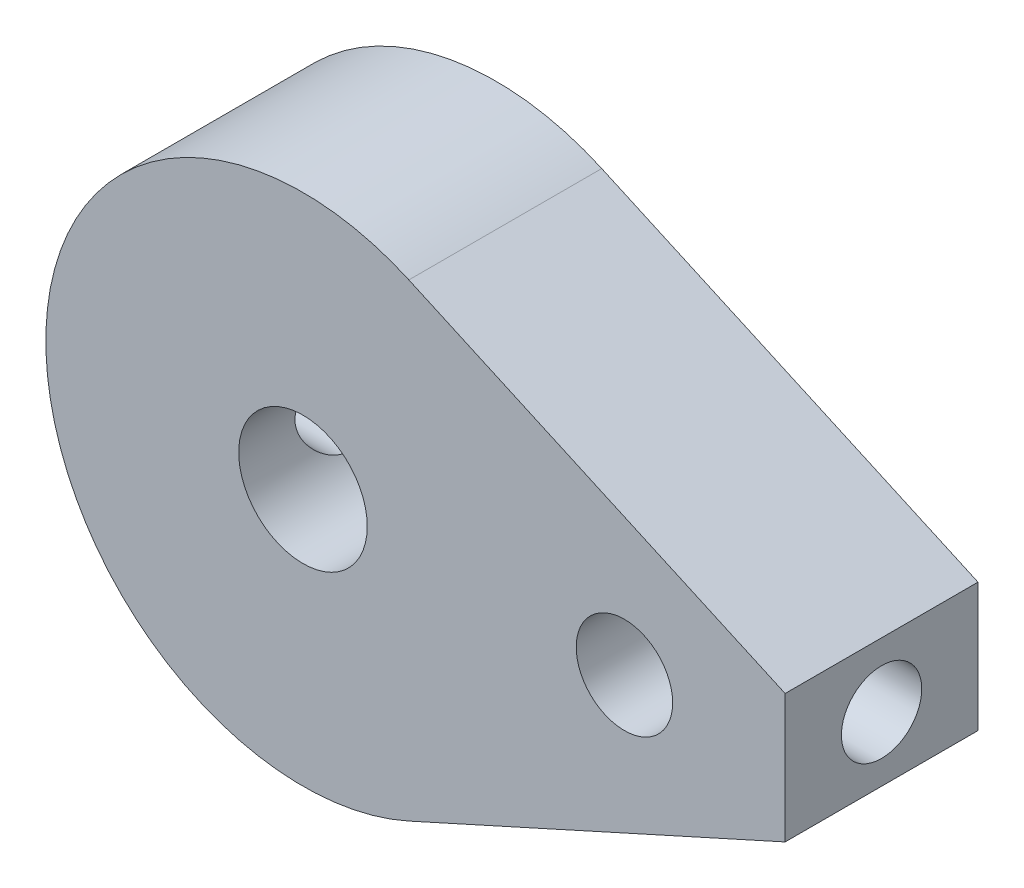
ISO-10303-21;
HEADER;
FILE_DESCRIPTION(('STEP AP214'),'2;1');
FILE_NAME('part.step','',(''),(''),'','','');
FILE_SCHEMA(('AUTOMOTIVE_DESIGN { 1 0 10303 214 1 1 1 1 }'));
ENDSEC;
DATA;
#1=APPLICATION_CONTEXT('core data for automotive mechanical design processes');
#2=APPLICATION_PROTOCOL_DEFINITION('international standard','automotive_design',2000,#1);
#3=PRODUCT_CONTEXT('',#1,'mechanical');
#4=PRODUCT('Part','Part','',(#3));
#5=PRODUCT_RELATED_PRODUCT_CATEGORY('part','',(#4));
#6=PRODUCT_DEFINITION_FORMATION('','',#4);
#7=PRODUCT_DEFINITION_CONTEXT('part definition',#1,'design');
#8=PRODUCT_DEFINITION('design','',#6,#7);
#9=PRODUCT_DEFINITION_SHAPE('','',#8);
#10=(LENGTH_UNIT() NAMED_UNIT(*) SI_UNIT(.MILLI.,.METRE.));
#11=(NAMED_UNIT(*) PLANE_ANGLE_UNIT() SI_UNIT($,.RADIAN.));
#12=(NAMED_UNIT(*) SI_UNIT($,.STERADIAN.) SOLID_ANGLE_UNIT());
#13=UNCERTAINTY_MEASURE_WITH_UNIT(LENGTH_MEASURE(1.E-05),#10,'distance_accuracy_value','');
#14=(GEOMETRIC_REPRESENTATION_CONTEXT(3) GLOBAL_UNCERTAINTY_ASSIGNED_CONTEXT((#13)) GLOBAL_UNIT_ASSIGNED_CONTEXT((#10,
#11,#12)) REPRESENTATION_CONTEXT('',''));
#15=CARTESIAN_POINT('',(0.,0.,0.));
#16=DIRECTION('',(0.,0.,1.));
#17=DIRECTION('',(1.,0.,0.));
#18=AXIS2_PLACEMENT_3D('',#15,#16,#17);
#19=CARTESIAN_POINT('',(-15.,0.,6.));
#20=DIRECTION('',(0.,0.,1.));
#21=DIRECTION('',(1.,0.,0.));
#22=AXIS2_PLACEMENT_3D('',#19,#20,#21);
#23=PLANE('',#22);
#24=CARTESIAN_POINT('',(-15.,0.,6.));
#25=DIRECTION('',(0.,0.,1.));
#26=DIRECTION('',(1.,0.,0.));
#27=AXIS2_PLACEMENT_3D('',#24,#25,#26);
#28=CIRCLE('',#27,2.);
#29=CARTESIAN_POINT('',(-13.,0.,6.));
#30=VERTEX_POINT('',#29);
#31=EDGE_CURVE('E104',#30,#30,#28,.T.);
#32=ORIENTED_EDGE('',*,*,#31,.F.);
#33=EDGE_LOOP('',(#32));
#34=FACE_BOUND('',#33,.T.);
#35=CARTESIAN_POINT('',(-15.,0.,6.));
#36=DIRECTION('',(0.,0.,1.));
#37=DIRECTION('',(1.,0.,0.));
#38=AXIS2_PLACEMENT_3D('',#35,#36,#37);
#39=CIRCLE('',#38,8.);
#40=CARTESIAN_POINT('',(-11.7053437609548,7.29007820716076,6.));
#41=VERTEX_POINT('',#40);
#42=CARTESIAN_POINT('',(-11.7053437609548,-7.29007820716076,6.));
#43=VERTEX_POINT('',#42);
#44=EDGE_CURVE('E89',#41,#43,#39,.T.);
#45=ORIENTED_EDGE('',*,*,#44,.T.);
#46=DIRECTION('',(0.911259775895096,0.411832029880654,0.));
#47=VECTOR('',#46,1.);
#48=CARTESIAN_POINT('',(0.,-2.,6.));
#49=LINE('',#48,#47);
#50=CARTESIAN_POINT('',(0.,-2.,6.));
#51=VERTEX_POINT('',#50);
#52=EDGE_CURVE('E84',#43,#51,#49,.T.);
#53=ORIENTED_EDGE('',*,*,#52,.T.);
#54=DIRECTION('',(0.,1.,0.));
#55=VECTOR('',#54,1.);
#56=CARTESIAN_POINT('',(0.,-2.,6.));
#57=LINE('',#56,#55);
#58=CARTESIAN_POINT('',(0.,2.,6.));
#59=VERTEX_POINT('',#58);
#60=EDGE_CURVE('E87',#51,#59,#57,.T.);
#61=ORIENTED_EDGE('',*,*,#60,.T.);
#62=DIRECTION('',(-0.911259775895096,0.411832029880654,0.));
#63=VECTOR('',#62,1.);
#64=CARTESIAN_POINT('',(0.,2.,6.));
#65=LINE('',#64,#63);
#66=EDGE_CURVE('E54',#59,#41,#65,.T.);
#67=ORIENTED_EDGE('',*,*,#66,.T.);
#68=EDGE_LOOP('',(#45,#53,#61,#67));
#69=FACE_BOUND('',#68,.T.);
#70=CARTESIAN_POINT('',(-5.,0.,6.));
#71=DIRECTION('',(0.,0.,1.));
#72=DIRECTION('',(1.,0.,0.));
#73=AXIS2_PLACEMENT_3D('',#70,#71,#72);
#74=CIRCLE('',#73,1.5);
#75=CARTESIAN_POINT('',(-3.5,0.,6.));
#76=VERTEX_POINT('',#75);
#77=EDGE_CURVE('E119',#76,#76,#74,.T.);
#78=ORIENTED_EDGE('',*,*,#77,.F.);
#79=EDGE_LOOP('',(#78));
#80=FACE_BOUND('',#79,.T.);
#81=ADVANCED_FACE('F36',(#34,#69,#80),#23,.T.);
#82=CARTESIAN_POINT('',(-15.,0.,0.));
#83=DIRECTION('',(0.,0.,1.));
#84=DIRECTION('',(1.,0.,0.));
#85=AXIS2_PLACEMENT_3D('',#82,#83,#84);
#86=PLANE('',#85);
#87=CARTESIAN_POINT('',(-15.,0.,0.));
#88=DIRECTION('',(0.,0.,1.));
#89=DIRECTION('',(1.,0.,0.));
#90=AXIS2_PLACEMENT_3D('',#87,#88,#89);
#91=CIRCLE('',#90,8.);
#92=CARTESIAN_POINT('',(-11.7053437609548,7.29007820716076,0.));
#93=VERTEX_POINT('',#92);
#94=CARTESIAN_POINT('',(-11.7053437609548,-7.29007820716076,0.));
#95=VERTEX_POINT('',#94);
#96=EDGE_CURVE('E101',#93,#95,#91,.T.);
#97=ORIENTED_EDGE('',*,*,#96,.F.);
#98=DIRECTION('',(-0.911259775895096,0.411832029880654,0.));
#99=VECTOR('',#98,1.);
#100=CARTESIAN_POINT('',(0.,2.,0.));
#101=LINE('',#100,#99);
#102=CARTESIAN_POINT('',(0.,2.,0.));
#103=VERTEX_POINT('',#102);
#104=EDGE_CURVE('E77',#103,#93,#101,.T.);
#105=ORIENTED_EDGE('',*,*,#104,.F.);
#106=DIRECTION('',(0.,1.,0.));
#107=VECTOR('',#106,1.);
#108=CARTESIAN_POINT('',(0.,-2.,0.));
#109=LINE('',#108,#107);
#110=CARTESIAN_POINT('',(0.,-2.,0.));
#111=VERTEX_POINT('',#110);
#112=EDGE_CURVE('E71',#111,#103,#109,.T.);
#113=ORIENTED_EDGE('',*,*,#112,.F.);
#114=DIRECTION('',(0.911259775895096,0.411832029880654,0.));
#115=VECTOR('',#114,1.);
#116=CARTESIAN_POINT('',(0.,-2.,0.));
#117=LINE('',#116,#115);
#118=EDGE_CURVE('E93',#95,#111,#117,.T.);
#119=ORIENTED_EDGE('',*,*,#118,.F.);
#120=EDGE_LOOP('',(#97,#105,#113,#119));
#121=FACE_BOUND('',#120,.T.);
#122=CARTESIAN_POINT('',(-15.,0.,0.));
#123=DIRECTION('',(0.,0.,1.));
#124=DIRECTION('',(1.,0.,0.));
#125=AXIS2_PLACEMENT_3D('',#122,#123,#124);
#126=CIRCLE('',#125,2.);
#127=CARTESIAN_POINT('',(-13.,0.,0.));
#128=VERTEX_POINT('',#127);
#129=EDGE_CURVE('E116',#128,#128,#126,.T.);
#130=ORIENTED_EDGE('',*,*,#129,.T.);
#131=EDGE_LOOP('',(#130));
#132=FACE_BOUND('',#131,.T.);
#133=CARTESIAN_POINT('',(-5.,0.,0.));
#134=DIRECTION('',(0.,0.,1.));
#135=DIRECTION('',(1.,0.,0.));
#136=AXIS2_PLACEMENT_3D('',#133,#134,#135);
#137=CIRCLE('',#136,1.5);
#138=CARTESIAN_POINT('',(-3.5,0.,0.));
#139=VERTEX_POINT('',#138);
#140=EDGE_CURVE('E122',#139,#139,#137,.T.);
#141=ORIENTED_EDGE('',*,*,#140,.T.);
#142=EDGE_LOOP('',(#141));
#143=FACE_BOUND('',#142,.T.);
#144=ADVANCED_FACE('F112',(#121,#132,#143),#86,.F.);
#145=CARTESIAN_POINT('',(-15.,0.,6.));
#146=DIRECTION('',(0.,0.,-1.));
#147=DIRECTION('',(-1.,0.,0.));
#148=AXIS2_PLACEMENT_3D('',#145,#146,#147);
#149=CYLINDRICAL_SURFACE('',#148,8.);
#150=CARTESIAN_POINT('',(-23.,0.,4.24999999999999));
#151=CARTESIAN_POINT('',(-22.9999988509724,-0.069757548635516,4.24999715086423));
#152=CARTESIAN_POINT('',(-22.9990780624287,-0.139554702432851,4.24414094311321));
#153=CARTESIAN_POINT('',(-22.995493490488,-0.277195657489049,4.22087815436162));
#154=CARTESIAN_POINT('',(-22.9928280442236,-0.345037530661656,4.20346055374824));
#155=CARTESIAN_POINT('',(-22.9860534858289,-0.476756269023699,4.15761016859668));
#156=CARTESIAN_POINT('',(-22.9819454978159,-0.540636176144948,4.12918595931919));
#157=CARTESIAN_POINT('',(-22.9727389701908,-0.662710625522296,4.06215072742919));
#158=CARTESIAN_POINT('',(-22.9676405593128,-0.72090590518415,4.02354102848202));
#159=CARTESIAN_POINT('',(-22.9569713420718,-0.830459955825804,3.93688347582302));
#160=CARTESIAN_POINT('',(-22.9513972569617,-0.881763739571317,3.88876650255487));
#161=CARTESIAN_POINT('',(-22.9404303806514,-0.97560384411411,3.78460902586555));
#162=CARTESIAN_POINT('',(-22.9350376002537,-1.01813964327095,3.7285680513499));
#163=CARTESIAN_POINT('',(-22.9250121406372,-1.09345272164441,3.60978086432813));
#164=CARTESIAN_POINT('',(-22.9203836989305,-1.12617636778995,3.5470002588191));
#165=CARTESIAN_POINT('',(-22.9124560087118,-1.18059340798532,3.4167492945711));
#166=CARTESIAN_POINT('',(-22.9091566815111,-1.20228745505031,3.34927921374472));
#167=CARTESIAN_POINT('',(-22.9042931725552,-1.23385779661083,3.21214454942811));
#168=CARTESIAN_POINT('',(-22.9027151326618,-1.24382852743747,3.1425022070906));
#169=CARTESIAN_POINT('',(-22.9014308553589,-1.2519618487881,3.00251640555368));
#170=CARTESIAN_POINT('',(-22.9017245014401,-1.25012517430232,2.93217299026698));
#171=CARTESIAN_POINT('',(-22.904137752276,-1.23477290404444,2.79345148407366));
#172=CARTESIAN_POINT('',(-22.9062408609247,-1.22136281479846,2.72506138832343));
#173=CARTESIAN_POINT('',(-22.9120102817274,-1.18340968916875,2.59151399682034));
#174=CARTESIAN_POINT('',(-22.9156766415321,-1.15886631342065,2.52635679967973));
#175=CARTESIAN_POINT('',(-22.9241775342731,-1.09923458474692,2.40080564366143));
#176=CARTESIAN_POINT('',(-22.9290169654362,-1.06410186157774,2.34043310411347));
#177=CARTESIAN_POINT('',(-22.9393152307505,-0.98432029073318,2.22640023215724));
#178=CARTESIAN_POINT('',(-22.9447741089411,-0.939670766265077,2.17274037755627));
#179=CARTESIAN_POINT('',(-22.9557689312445,-0.841545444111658,2.07304487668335));
#180=CARTESIAN_POINT('',(-22.9613050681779,-0.78797900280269,2.02709842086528));
#181=CARTESIAN_POINT('',(-22.9717756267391,-0.673848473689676,1.94483342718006));
#182=CARTESIAN_POINT('',(-22.9767100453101,-0.613284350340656,1.90851493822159));
#183=CARTESIAN_POINT('',(-22.9854269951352,-0.486797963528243,1.84653096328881));
#184=CARTESIAN_POINT('',(-22.9892087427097,-0.420872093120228,1.82087272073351));
#185=CARTESIAN_POINT('',(-22.9951878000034,-0.285574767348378,1.78101701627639));
#186=CARTESIAN_POINT('',(-22.9973852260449,-0.216203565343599,1.76681871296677));
#187=CARTESIAN_POINT('',(-22.9999325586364,-0.0767541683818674,1.75040536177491));
#188=CARTESIAN_POINT('',(-23.0003013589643,-0.00669073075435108,1.74806776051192));
#189=CARTESIAN_POINT('',(-22.9992014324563,0.13282727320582,1.755116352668));
#190=CARTESIAN_POINT('',(-22.9977327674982,0.202281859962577,1.76450215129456));
#191=CARTESIAN_POINT('',(-22.9931346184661,0.33823672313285,1.7946291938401));
#192=CARTESIAN_POINT('',(-22.9900139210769,0.404750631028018,1.81531037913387));
#193=CARTESIAN_POINT('',(-22.9824603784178,0.53336703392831,1.8673775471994));
#194=CARTESIAN_POINT('',(-22.9780274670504,0.5954693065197,1.89876406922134));
#195=CARTESIAN_POINT('',(-22.9682948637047,0.714036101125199,1.97163599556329));
#196=CARTESIAN_POINT('',(-22.9629886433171,0.770452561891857,2.01319871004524));
#197=CARTESIAN_POINT('',(-22.9521194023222,0.875553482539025,2.1051360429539));
#198=CARTESIAN_POINT('',(-22.9465563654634,0.924237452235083,2.15551121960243));
#199=CARTESIAN_POINT('',(-22.9357401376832,1.01294040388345,2.26419059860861));
#200=CARTESIAN_POINT('',(-22.930490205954,1.05287699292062,2.32256242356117));
#201=CARTESIAN_POINT('',(-22.9209534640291,1.12237783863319,2.44525803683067));
#202=CARTESIAN_POINT('',(-22.91666662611,1.15194239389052,2.50958165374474));
#203=CARTESIAN_POINT('',(-22.9095653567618,1.19973385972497,2.6421148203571));
#204=CARTESIAN_POINT('',(-22.9067454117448,1.21800327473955,2.71030873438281));
#205=CARTESIAN_POINT('',(-22.902882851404,1.24282061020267,2.84884457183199));
#206=CARTESIAN_POINT('',(-22.9018401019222,1.24936941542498,2.9191863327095));
#207=CARTESIAN_POINT('',(-22.9016552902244,1.25053726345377,3.05919935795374));
#208=CARTESIAN_POINT('',(-22.9024925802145,1.24528590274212,3.12886954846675));
#209=CARTESIAN_POINT('',(-22.9059284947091,1.2232811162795,3.26632264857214));
#210=CARTESIAN_POINT('',(-22.9085271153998,1.2065277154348,3.33410556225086));
#211=CARTESIAN_POINT('',(-22.9151854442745,1.16204164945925,3.46581891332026));
#212=CARTESIAN_POINT('',(-22.919243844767,1.1343188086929,3.5297527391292));
#213=CARTESIAN_POINT('',(-22.928365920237,1.06869384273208,3.65208280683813));
#214=CARTESIAN_POINT('',(-22.9334296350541,1.03079131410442,3.71047882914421));
#215=CARTESIAN_POINT('',(-22.9440578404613,0.945415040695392,3.82073277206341));
#216=CARTESIAN_POINT('',(-22.9496270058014,0.897845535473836,3.87251609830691));
#217=CARTESIAN_POINT('',(-22.9606002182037,0.794687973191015,3.96741061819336));
#218=CARTESIAN_POINT('',(-22.9660042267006,0.739098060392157,4.01051979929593));
#219=CARTESIAN_POINT('',(-22.9760755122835,0.621083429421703,4.08707561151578));
#220=CARTESIAN_POINT('',(-22.9807381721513,0.558619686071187,4.1204626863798));
#221=CARTESIAN_POINT('',(-22.9887562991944,0.428925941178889,4.17622049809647));
#222=CARTESIAN_POINT('',(-22.9921131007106,0.361700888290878,4.19860248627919));
#223=CARTESIAN_POINT('',(-22.9963872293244,0.245157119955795,4.22671651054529));
#224=CARTESIAN_POINT('',(-22.9977349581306,0.19655278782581,4.23543424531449));
#225=CARTESIAN_POINT('',(-22.9995417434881,0.0986388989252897,4.24707695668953));
#226=CARTESIAN_POINT('',(-23.0000008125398,0.0493293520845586,4.25000201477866));
#227=CARTESIAN_POINT('',(-23.,0.,4.24999999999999));
#228=B_SPLINE_CURVE_WITH_KNOTS('',3,(#150,#151,#152,#153,#154,#155,#156,#157,#158,#159,#160,
#161,#162,#163,#164,#165,#166,#167,#168,#169,#170,#171,#172,#173,#174,#175,#176,#177,#178,#179,
#180,#181,#182,#183,#184,#185,#186,#187,#188,#189,#190,#191,#192,#193,#194,#195,#196,#197,#198,
#199,#200,#201,#202,#203,#204,#205,#206,#207,#208,#209,#210,#211,#212,#213,#214,#215,#216,#217,
#218,#219,#220,#221,#222,#223,#224,#225,#226,#227),.UNSPECIFIED.,.T.,.F.,(4,2,2,2,2,2,2,2,2,2,2,
2,2,2,2,2,2,2,2,2,2,2,2,2,2,2,2,2,2,2,2,2,2,2,2,2,2,2,4),(0.,0.209092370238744,
0.418384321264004,0.62751353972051,0.836615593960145,1.04729784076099,1.2579926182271,
1.46981889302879,1.68163262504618,1.89172815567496,2.10181060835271,2.30999788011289,
2.51819149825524,2.72726988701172,2.93636314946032,3.14772866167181,3.35909524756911,
3.5706052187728,3.78209965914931,3.99140427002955,4.20070183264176,4.40889722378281,
4.61710310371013,4.82694270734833,5.03679560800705,5.24854740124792,5.46029309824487,
5.67123705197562,5.88216508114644,6.09078790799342,6.29941028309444,6.50784623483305,
6.7162904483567,6.92691006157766,7.13757848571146,7.34951152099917,7.56122742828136,
7.70909008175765,7.8569506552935),.UNSPECIFIED.);
#229=CARTESIAN_POINT('',(-23.,0.,4.24999999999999));
#230=VERTEX_POINT('',#229);
#231=EDGE_CURVE('E153',#230,#230,#228,.T.);
#232=ORIENTED_EDGE('',*,*,#231,.T.);
#233=EDGE_LOOP('',(#232));
#234=FACE_BOUND('',#233,.T.);
#235=ORIENTED_EDGE('',*,*,#96,.T.);
#236=DIRECTION('',(0.,0.,-1.));
#237=VECTOR('',#236,1.);
#238=CARTESIAN_POINT('',(-11.7053437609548,-7.29007820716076,6.));
#239=LINE('',#238,#237);
#240=EDGE_CURVE('E11',#43,#95,#239,.T.);
#241=ORIENTED_EDGE('',*,*,#240,.F.);
#242=ORIENTED_EDGE('',*,*,#44,.F.);
#243=DIRECTION('',(0.,0.,-1.));
#244=VECTOR('',#243,1.);
#245=CARTESIAN_POINT('',(-11.7053437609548,7.29007820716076,6.));
#246=LINE('',#245,#244);
#247=EDGE_CURVE('E97',#41,#93,#246,.T.);
#248=ORIENTED_EDGE('',*,*,#247,.T.);
#249=EDGE_LOOP('',(#235,#241,#242,#248));
#250=FACE_BOUND('',#249,.T.);
#251=ADVANCED_FACE('F38',(#234,#250),#149,.T.);
#252=CARTESIAN_POINT('',(0.,-2.,6.));
#253=DIRECTION('',(-0.411832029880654,0.911259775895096,0.));
#254=DIRECTION('',(-0.911259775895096,-0.411832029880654,0.));
#255=AXIS2_PLACEMENT_3D('',#252,#253,#254);
#256=PLANE('',#255);
#257=ORIENTED_EDGE('',*,*,#118,.T.);
#258=DIRECTION('',(0.,0.,-1.));
#259=VECTOR('',#258,1.);
#260=CARTESIAN_POINT('',(0.,-2.,6.));
#261=LINE('',#260,#259);
#262=EDGE_CURVE('E46',#51,#111,#261,.T.);
#263=ORIENTED_EDGE('',*,*,#262,.F.);
#264=ORIENTED_EDGE('',*,*,#52,.F.);
#265=ORIENTED_EDGE('',*,*,#240,.T.);
#266=EDGE_LOOP('',(#257,#263,#264,#265));
#267=FACE_BOUND('',#266,.T.);
#268=ADVANCED_FACE('F92',(#267),#256,.F.);
#269=CARTESIAN_POINT('',(0.,-2.,6.));
#270=DIRECTION('',(-1.,0.,0.));
#271=DIRECTION('',(0.,0.,1.));
#272=AXIS2_PLACEMENT_3D('',#269,#270,#271);
#273=PLANE('',#272);
#274=CARTESIAN_POINT('',(0.,0.,3.));
#275=DIRECTION('',(1.,0.,0.));
#276=DIRECTION('',(0.,0.,-1.));
#277=AXIS2_PLACEMENT_3D('',#274,#275,#276);
#278=CIRCLE('',#277,1.24999999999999);
#279=CARTESIAN_POINT('',(0.,0.,1.75000000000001));
#280=VERTEX_POINT('',#279);
#281=EDGE_CURVE('E134',#280,#280,#278,.T.);
#282=ORIENTED_EDGE('',*,*,#281,.F.);
#283=EDGE_LOOP('',(#282));
#284=FACE_BOUND('',#283,.T.);
#285=ORIENTED_EDGE('',*,*,#112,.T.);
#286=DIRECTION('',(0.,0.,-1.));
#287=VECTOR('',#286,1.);
#288=CARTESIAN_POINT('',(0.,2.,6.));
#289=LINE('',#288,#287);
#290=EDGE_CURVE('E94',#59,#103,#289,.T.);
#291=ORIENTED_EDGE('',*,*,#290,.F.);
#292=ORIENTED_EDGE('',*,*,#60,.F.);
#293=ORIENTED_EDGE('',*,*,#262,.T.);
#294=EDGE_LOOP('',(#285,#291,#292,#293));
#295=FACE_BOUND('',#294,.T.);
#296=ADVANCED_FACE('F95',(#284,#295),#273,.F.);
#297=CARTESIAN_POINT('',(0.,2.,6.));
#298=DIRECTION('',(-0.411832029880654,-0.911259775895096,0.));
#299=DIRECTION('',(0.911259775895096,-0.411832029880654,0.));
#300=AXIS2_PLACEMENT_3D('',#297,#298,#299);
#301=PLANE('',#300);
#302=ORIENTED_EDGE('',*,*,#104,.T.);
#303=ORIENTED_EDGE('',*,*,#247,.F.);
#304=ORIENTED_EDGE('',*,*,#66,.F.);
#305=ORIENTED_EDGE('',*,*,#290,.T.);
#306=EDGE_LOOP('',(#302,#303,#304,#305));
#307=FACE_BOUND('',#306,.T.);
#308=ADVANCED_FACE('F109',(#307),#301,.F.);
#309=CARTESIAN_POINT('',(-15.,0.,6.));
#310=DIRECTION('',(0.,0.,-1.));
#311=DIRECTION('',(-1.,0.,0.));
#312=AXIS2_PLACEMENT_3D('',#309,#310,#311);
#313=CYLINDRICAL_SURFACE('',#312,2.);
#314=CARTESIAN_POINT('',(-17.,0.,4.24999999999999));
#315=CARTESIAN_POINT('',(-16.9999959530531,-0.0635104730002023,4.24999565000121));
#316=CARTESIAN_POINT('',(-16.99694323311,-0.127096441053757,4.24512698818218));
#317=CARTESIAN_POINT('',(-16.985021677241,-0.252318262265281,4.22591419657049));
#318=CARTESIAN_POINT('',(-16.976141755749,-0.313950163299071,4.21155200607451));
#319=CARTESIAN_POINT('',(-16.9534585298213,-0.43320555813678,4.17418863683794));
#320=CARTESIAN_POINT('',(-16.9396796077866,-0.490847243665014,4.15123021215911));
#321=CARTESIAN_POINT('',(-16.9083459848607,-0.601260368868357,4.09761414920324));
#322=CARTESIAN_POINT('',(-16.8907917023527,-0.654032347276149,4.0669573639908));
#323=CARTESIAN_POINT('',(-16.8517015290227,-0.75797419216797,3.99611342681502));
#324=CARTESIAN_POINT('',(-16.8299596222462,-0.808679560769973,3.95536070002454));
#325=CARTESIAN_POINT('',(-16.7853134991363,-0.902986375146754,3.86678082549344));
#326=CARTESIAN_POINT('',(-16.7624077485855,-0.946578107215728,3.81894417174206));
#327=CARTESIAN_POINT('',(-16.714304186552,-1.03142873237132,3.70996610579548));
#328=CARTESIAN_POINT('',(-16.6892161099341,-1.0715720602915,3.64790021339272));
#329=CARTESIAN_POINT('',(-16.6433019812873,-1.14073966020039,3.51643518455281));
#330=CARTESIAN_POINT('',(-16.6224687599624,-1.16978270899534,3.44704868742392));
#331=CARTESIAN_POINT('',(-16.5930957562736,-1.2093340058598,3.32118947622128));
#332=CARTESIAN_POINT('',(-16.5827690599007,-1.22269552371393,3.26603318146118));
#333=CARTESIAN_POINT('',(-16.5678135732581,-1.24181843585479,3.1536940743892));
#334=CARTESIAN_POINT('',(-16.5631767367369,-1.24759056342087,3.09651424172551));
#335=CARTESIAN_POINT('',(-16.5602988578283,-1.25118918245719,2.98158698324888));
#336=CARTESIAN_POINT('',(-16.5620745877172,-1.2489948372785,2.9238384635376));
#337=CARTESIAN_POINT('',(-16.5717740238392,-1.23676317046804,2.80968989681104));
#338=CARTESIAN_POINT('',(-16.5797026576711,-1.22671956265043,2.75329096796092));
#339=CARTESIAN_POINT('',(-16.6003257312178,-1.19968103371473,2.64456154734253));
#340=CARTESIAN_POINT('',(-16.6129071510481,-1.18285016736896,2.59216754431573));
#341=CARTESIAN_POINT('',(-16.6414556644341,-1.14290189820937,2.49083881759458));
#342=CARTESIAN_POINT('',(-16.6574239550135,-1.11978227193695,2.44190532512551));
#343=CARTESIAN_POINT('',(-16.6945481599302,-1.06294892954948,2.33916672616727));
#344=CARTESIAN_POINT('',(-16.7161159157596,-1.0280629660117,2.28615918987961));
#345=CARTESIAN_POINT('',(-16.7600571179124,-0.950881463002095,2.18616972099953));
#346=CARTESIAN_POINT('',(-16.7824313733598,-0.908578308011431,2.13919406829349));
#347=CARTESIAN_POINT('',(-16.8297989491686,-0.809519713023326,2.04469825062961));
#348=CARTESIAN_POINT('',(-16.8546153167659,-0.751531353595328,1.99836702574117));
#349=CARTESIAN_POINT('',(-16.9002805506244,-0.627148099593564,1.91614910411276));
#350=CARTESIAN_POINT('',(-16.9211309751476,-0.560756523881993,1.88025830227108));
#351=CARTESIAN_POINT('',(-16.9555337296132,-0.424883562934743,1.82223631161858));
#352=CARTESIAN_POINT('',(-16.9694197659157,-0.355763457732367,1.79946596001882));
#353=CARTESIAN_POINT('',(-16.9898492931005,-0.213612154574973,1.76623507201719));
#354=CARTESIAN_POINT('',(-16.9964031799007,-0.140586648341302,1.755757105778));
#355=CARTESIAN_POINT('',(-17.0009784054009,-0.00451561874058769,1.74843414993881));
#356=CARTESIAN_POINT('',(-17.0001216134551,0.058402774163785,1.74979682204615));
#357=CARTESIAN_POINT('',(-16.9925890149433,0.182972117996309,1.76188282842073));
#358=CARTESIAN_POINT('',(-16.9859136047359,0.244623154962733,1.77260552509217));
#359=CARTESIAN_POINT('',(-16.9677405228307,0.362521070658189,1.80223853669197));
#360=CARTESIAN_POINT('',(-16.9564417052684,0.418885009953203,1.82081215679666));
#361=CARTESIAN_POINT('',(-16.9299568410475,0.527638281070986,1.86529638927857));
#362=CARTESIAN_POINT('',(-16.9147701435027,0.580026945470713,1.89120823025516));
#363=CARTESIAN_POINT('',(-16.87990012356,0.685084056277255,1.95251520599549));
#364=CARTESIAN_POINT('',(-16.8599176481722,0.737246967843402,1.98860356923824));
#365=CARTESIAN_POINT('',(-16.8180697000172,0.835142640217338,2.06779386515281));
#366=CARTESIAN_POINT('',(-16.7962021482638,0.88086815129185,2.11090358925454));
#367=CARTESIAN_POINT('',(-16.7490586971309,0.971474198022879,2.21013503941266));
#368=CARTESIAN_POINT('',(-16.7237488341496,1.01526851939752,2.26723720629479));
#369=CARTESIAN_POINT('',(-16.6756676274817,1.09280351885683,2.38887578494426));
#370=CARTESIAN_POINT('',(-16.6528945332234,1.12655115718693,2.453407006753));
#371=CARTESIAN_POINT('',(-16.6173353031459,1.17684772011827,2.57469214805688));
#372=CARTESIAN_POINT('',(-16.6034563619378,1.19551895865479,2.63024075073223));
#373=CARTESIAN_POINT('',(-16.5810503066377,1.22500108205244,2.74439314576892));
#374=CARTESIAN_POINT('',(-16.5725148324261,1.23582424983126,2.80299200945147));
#375=CARTESIAN_POINT('',(-16.5620632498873,1.24901383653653,2.92209027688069));
#376=CARTESIAN_POINT('',(-16.5601850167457,1.25133186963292,2.98259858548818));
#377=CARTESIAN_POINT('',(-16.5634906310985,1.24719778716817,3.10313096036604));
#378=CARTESIAN_POINT('',(-16.5686768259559,1.24074275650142,3.16315485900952));
#379=CARTESIAN_POINT('',(-16.5845538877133,1.22038272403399,3.27602979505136));
#380=CARTESIAN_POINT('',(-16.5947680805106,1.20711919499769,3.32906930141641));
#381=CARTESIAN_POINT('',(-16.6191753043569,1.17417623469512,3.43213505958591));
#382=CARTESIAN_POINT('',(-16.6333699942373,1.15449412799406,3.48216004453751));
#383=CARTESIAN_POINT('',(-16.6666390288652,1.10602690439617,3.5855967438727));
#384=CARTESIAN_POINT('',(-16.68612230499,1.07633644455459,3.63845029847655));
#385=CARTESIAN_POINT('',(-16.7266770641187,1.01000017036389,3.73893836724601));
#386=CARTESIAN_POINT('',(-16.7477498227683,0.973348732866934,3.78656861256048));
#387=CARTESIAN_POINT('',(-16.7940191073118,0.885670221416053,3.88501425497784));
#388=CARTESIAN_POINT('',(-16.8192054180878,0.833233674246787,3.93459084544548));
#389=CARTESIAN_POINT('',(-16.8669872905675,0.719822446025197,4.02449482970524));
#390=CARTESIAN_POINT('',(-16.8895812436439,0.658842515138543,4.0648164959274));
#391=CARTESIAN_POINT('',(-16.9298671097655,0.529355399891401,4.1347711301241));
#392=CARTESIAN_POINT('',(-16.9475507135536,0.460835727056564,4.16438600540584));
#393=CARTESIAN_POINT('',(-16.9758152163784,0.318394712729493,4.21107188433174));
#394=CARTESIAN_POINT('',(-16.9864212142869,0.244493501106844,4.22818723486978));
#395=CARTESIAN_POINT('',(-16.9951947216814,0.14141848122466,4.24229920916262));
#396=CARTESIAN_POINT('',(-16.996991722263,0.113248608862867,4.24518186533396));
#397=CARTESIAN_POINT('',(-16.9993953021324,0.0567241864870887,4.2490332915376));
#398=CARTESIAN_POINT('',(-17.0000018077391,0.0283696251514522,4.25000194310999));
#399=CARTESIAN_POINT('',(-17.,0.,4.24999999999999));
#400=B_SPLINE_CURVE_WITH_KNOTS('',3,(#314,#315,#316,#317,#318,#319,#320,#321,#322,#323,#324,
#325,#326,#327,#328,#329,#330,#331,#332,#333,#334,#335,#336,#337,#338,#339,#340,#341,#342,#343,
#344,#345,#346,#347,#348,#349,#350,#351,#352,#353,#354,#355,#356,#357,#358,#359,#360,#361,#362,
#363,#364,#365,#366,#367,#368,#369,#370,#371,#372,#373,#374,#375,#376,#377,#378,#379,#380,#381,
#382,#383,#384,#385,#386,#387,#388,#389,#390,#391,#392,#393,#394,#395,#396,#397,#398,#399),
.UNSPECIFIED.,.T.,.F.,(4,2,2,2,2,2,2,2,2,2,2,2,2,2,2,2,2,2,2,2,2,2,2,2,2,2,2,2,2,2,2,2,2,2,2,2,
2,2,2,2,2,2,4),(0.,0.190412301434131,0.38118789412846,0.571026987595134,0.760845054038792,
0.965821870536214,1.17107628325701,1.40412975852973,1.6367872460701,1.80912008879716,
1.9812089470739,2.15374823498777,2.32642584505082,2.49515839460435,2.66395067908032,
2.86427450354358,3.0648052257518,3.2984218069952,3.53194640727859,3.75284174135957,
3.97342347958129,4.16127180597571,4.34910733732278,4.52959504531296,4.71011298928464,
4.9088523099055,5.10781368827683,5.3356570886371,5.56334227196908,5.74329940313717,
5.92297427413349,6.10366974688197,6.28442527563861,6.45063169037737,6.61690747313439,
6.80725523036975,6.99775741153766,7.22600539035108,7.45439424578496,7.68316725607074,
7.91112460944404,7.99617501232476,8.08123067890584),.UNSPECIFIED.);
#401=CARTESIAN_POINT('',(-17.,0.,4.24999999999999));
#402=VERTEX_POINT('',#401);
#403=EDGE_CURVE('E149',#402,#402,#400,.T.);
#404=ORIENTED_EDGE('',*,*,#403,.F.);
#405=EDGE_LOOP('',(#404));
#406=FACE_BOUND('',#405,.T.);
#407=ORIENTED_EDGE('',*,*,#31,.T.);
#408=EDGE_LOOP('',(#407));
#409=FACE_BOUND('',#408,.T.);
#410=ORIENTED_EDGE('',*,*,#129,.F.);
#411=EDGE_LOOP('',(#410));
#412=FACE_BOUND('',#411,.T.);
#413=ADVANCED_FACE('F169',(#406,#409,#412),#313,.F.);
#414=CARTESIAN_POINT('',(-5.,0.,6.));
#415=DIRECTION('',(0.,0.,-1.));
#416=DIRECTION('',(-1.,0.,0.));
#417=AXIS2_PLACEMENT_3D('',#414,#415,#416);
#418=CYLINDRICAL_SURFACE('',#417,1.5);
#419=CARTESIAN_POINT('',(-3.5,0.,1.75000000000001));
#420=CARTESIAN_POINT('',(-3.50000239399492,-0.0593787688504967,1.75000244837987));
#421=CARTESIAN_POINT('',(-3.50355666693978,-0.118775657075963,1.75426126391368));
#422=CARTESIAN_POINT('',(-3.51744616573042,-0.235591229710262,1.77098134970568));
#423=CARTESIAN_POINT('',(-3.52778641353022,-0.293008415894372,1.78344869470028));
#424=CARTESIAN_POINT('',(-3.55428662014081,-0.40391503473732,1.81565610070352));
#425=CARTESIAN_POINT('',(-3.57041178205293,-0.457425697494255,1.83535269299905));
#426=CARTESIAN_POINT('',(-3.60735385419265,-0.559920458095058,1.8810083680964));
#427=CARTESIAN_POINT('',(-3.62817234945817,-0.608903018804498,1.90696956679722));
#428=CARTESIAN_POINT('',(-3.68163039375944,-0.718951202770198,1.97472767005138));
#429=CARTESIAN_POINT('',(-3.71580315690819,-0.777846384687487,2.01883857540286));
#430=CARTESIAN_POINT('',(-3.78788095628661,-0.886006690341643,2.11525867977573));
#431=CARTESIAN_POINT('',(-3.82579623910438,-0.935244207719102,2.1675906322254));
#432=CARTESIAN_POINT('',(-3.9030045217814,-1.02476981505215,2.28052433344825));
#433=CARTESIAN_POINT('',(-3.94231003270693,-1.06487540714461,2.3412612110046));
#434=CARTESIAN_POINT('',(-4.01752662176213,-1.13460946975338,2.4703506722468));
#435=CARTESIAN_POINT('',(-4.05344743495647,-1.16426870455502,2.53868010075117));
#436=CARTESIAN_POINT('',(-4.10103329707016,-1.20096809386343,2.65084767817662));
#437=CARTESIAN_POINT('',(-4.11631654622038,-1.21216917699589,2.69176584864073));
#438=CARTESIAN_POINT('',(-4.14203599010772,-1.23050643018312,2.77594109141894));
#439=CARTESIAN_POINT('',(-4.15248393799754,-1.23765246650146,2.81919220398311));
#440=CARTESIAN_POINT('',(-4.16689486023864,-1.24740539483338,2.90788380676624));
#441=CARTESIAN_POINT('',(-4.17077739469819,-1.24995600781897,2.9533445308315));
#442=CARTESIAN_POINT('',(-4.17090850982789,-1.25004286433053,3.04428075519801));
#443=CARTESIAN_POINT('',(-4.16715699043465,-1.24757904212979,3.08975625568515));
#444=CARTESIAN_POINT('',(-4.15229211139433,-1.23752620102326,3.18276354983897));
#445=CARTESIAN_POINT('',(-4.14059168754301,-1.22952745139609,3.2301512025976));
#446=CARTESIAN_POINT('',(-4.11155746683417,-1.20871318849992,3.32210114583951));
#447=CARTESIAN_POINT('',(-4.09420500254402,-1.19588169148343,3.36665348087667));
#448=CARTESIAN_POINT('',(-4.04486086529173,-1.15722563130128,3.47810439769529));
#449=CARTESIAN_POINT('',(-4.01026545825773,-1.1281992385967,3.54271488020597));
#450=CARTESIAN_POINT('',(-3.93823637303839,-1.06071724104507,3.66502873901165));
#451=CARTESIAN_POINT('',(-3.9007977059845,-1.02224478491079,3.72271949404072));
#452=CARTESIAN_POINT('',(-3.82461504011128,-0.933838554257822,3.83412041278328));
#453=CARTESIAN_POINT('',(-3.785904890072,-0.883411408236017,3.88746569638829));
#454=CARTESIAN_POINT('',(-3.71245088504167,-0.77241956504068,3.98555963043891));
#455=CARTESIAN_POINT('',(-3.67769854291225,-0.711877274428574,4.03032682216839));
#456=CARTESIAN_POINT('',(-3.6228561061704,-0.597056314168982,4.0997068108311));
#457=CARTESIAN_POINT('',(-3.6012584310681,-0.544863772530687,4.12657128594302));
#458=CARTESIAN_POINT('',(-3.56346079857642,-0.435535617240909,4.1731715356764));
#459=CARTESIAN_POINT('',(-3.54725747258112,-0.378403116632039,4.19291175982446));
#460=CARTESIAN_POINT('',(-3.52145087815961,-0.259977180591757,4.22420858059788));
#461=CARTESIAN_POINT('',(-3.5118986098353,-0.198655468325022,4.23570196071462));
#462=CARTESIAN_POINT('',(-3.50054281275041,-0.0742799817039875,4.24935462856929));
#463=CARTESIAN_POINT('',(-3.49873409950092,-0.0112273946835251,4.25152016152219));
#464=CARTESIAN_POINT('',(-3.50277501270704,0.106655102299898,4.24666877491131));
#465=CARTESIAN_POINT('',(-3.5077332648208,0.161565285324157,4.24072067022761));
#466=CARTESIAN_POINT('',(-3.52337203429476,0.269322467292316,4.22186653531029));
#467=CARTESIAN_POINT('',(-3.53405323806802,0.322169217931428,4.20895967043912));
#468=CARTESIAN_POINT('',(-3.56055245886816,0.42528280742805,4.17668826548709));
#469=CARTESIAN_POINT('',(-3.57643742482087,0.475505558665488,4.15723946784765));
#470=CARTESIAN_POINT('',(-3.61231912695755,0.571829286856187,4.1128023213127));
#471=CARTESIAN_POINT('',(-3.63231738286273,0.617928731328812,4.08781192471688));
#472=CARTESIAN_POINT('',(-3.68512558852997,0.725338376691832,4.02078335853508));
#473=CARTESIAN_POINT('',(-3.71965486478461,0.784177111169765,3.97613035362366));
#474=CARTESIAN_POINT('',(-3.79238166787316,0.892139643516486,3.87858317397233));
#475=CARTESIAN_POINT('',(-3.83059039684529,0.941232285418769,3.82566350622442));
#476=CARTESIAN_POINT('',(-3.90823568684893,1.03033901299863,3.71151204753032));
#477=CARTESIAN_POINT('',(-3.94768196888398,1.07017375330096,3.65014776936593));
#478=CARTESIAN_POINT('',(-4.02289413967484,1.13922410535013,3.51970741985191));
#479=CARTESIAN_POINT('',(-4.05867178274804,1.1684744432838,3.45065755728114));
#480=CARTESIAN_POINT('',(-4.10536481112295,1.20418713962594,3.33785101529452));
#481=CARTESIAN_POINT('',(-4.12014446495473,1.21494166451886,3.2970790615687));
#482=CARTESIAN_POINT('',(-4.14478665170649,1.23241118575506,3.21327772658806));
#483=CARTESIAN_POINT('',(-4.15466145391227,1.23913627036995,3.17025427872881));
#484=CARTESIAN_POINT('',(-4.16792290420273,1.24808646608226,3.08218011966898));
#485=CARTESIAN_POINT('',(-4.17123368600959,1.25025897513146,3.03711179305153));
#486=CARTESIAN_POINT('',(-4.17037851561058,1.24969100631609,2.94707393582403));
#487=CARTESIAN_POINT('',(-4.16621059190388,1.24694923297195,2.90210443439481));
#488=CARTESIAN_POINT('',(-4.15053581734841,1.23632620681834,2.80916250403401));
#489=CARTESIAN_POINT('',(-4.13829452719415,1.2279286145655,2.76138043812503));
#490=CARTESIAN_POINT('',(-4.10820497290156,1.20625214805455,2.66873879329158));
#491=CARTESIAN_POINT('',(-4.09033819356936,1.19295712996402,2.62388946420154));
#492=CARTESIAN_POINT('',(-4.03970661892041,1.1529905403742,2.51165820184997));
#493=CARTESIAN_POINT('',(-4.00437642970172,1.12305667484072,2.44661867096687));
#494=CARTESIAN_POINT('',(-3.93106891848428,1.05354944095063,2.32359036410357));
#495=CARTESIAN_POINT('',(-3.8930870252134,1.01395911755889,2.26561426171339));
#496=CARTESIAN_POINT('',(-3.81615174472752,0.923157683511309,2.15400924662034));
#497=CARTESIAN_POINT('',(-3.77724194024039,0.871472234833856,2.10073251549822));
#498=CARTESIAN_POINT('',(-3.70371360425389,0.757765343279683,2.00306469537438));
#499=CARTESIAN_POINT('',(-3.66908563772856,0.695767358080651,1.95865393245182));
#500=CARTESIAN_POINT('',(-3.61528913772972,0.579278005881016,1.89084348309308));
#501=CARTESIAN_POINT('',(-3.59443930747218,0.526999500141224,1.86498089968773));
#502=CARTESIAN_POINT('',(-3.55819251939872,0.417719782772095,1.82039051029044));
#503=CARTESIAN_POINT('',(-3.54278829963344,0.360724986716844,1.80165319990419));
#504=CARTESIAN_POINT('',(-3.52070630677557,0.25331004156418,1.77490580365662));
#505=CARTESIAN_POINT('',(-3.51298929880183,0.203422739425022,1.76561244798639));
#506=CARTESIAN_POINT('',(-3.50263537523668,0.102361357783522,1.75315880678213));
#507=CARTESIAN_POINT('',(-3.49999793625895,0.0511874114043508,1.74999788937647));
#508=CARTESIAN_POINT('',(-3.5,0.,1.75000000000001));
#509=B_SPLINE_CURVE_WITH_KNOTS('',3,(#419,#420,#421,#422,#423,#424,#425,#426,#427,#428,#429,
#430,#431,#432,#433,#434,#435,#436,#437,#438,#439,#440,#441,#442,#443,#444,#445,#446,#447,#448,
#449,#450,#451,#452,#453,#454,#455,#456,#457,#458,#459,#460,#461,#462,#463,#464,#465,#466,#467,
#468,#469,#470,#471,#472,#473,#474,#475,#476,#477,#478,#479,#480,#481,#482,#483,#484,#485,#486,
#487,#488,#489,#490,#491,#492,#493,#494,#495,#496,#497,#498,#499,#500,#501,#502,#503,#504,#505,
#506,#507,#508),.UNSPECIFIED.,.T.,.F.,(4,2,2,2,2,2,2,2,2,2,2,2,2,2,2,2,2,2,2,2,2,2,2,2,2,2,2,2,
2,2,2,2,2,2,2,2,2,2,2,2,2,2,2,2,4),(0.,0.177920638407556,0.355973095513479,0.532972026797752,
0.710030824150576,0.952125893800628,1.19490321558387,1.4421737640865,1.68870989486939,
1.82361318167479,1.95818681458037,2.0943976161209,2.23061020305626,2.37816635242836,
2.52621487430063,2.76143398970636,2.9970758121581,3.24501566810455,3.49241341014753,
3.67933989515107,3.86614943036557,4.0543760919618,4.24247671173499,4.40804641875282,
4.57363598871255,4.74144560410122,4.90931733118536,5.152610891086,5.39667010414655,
5.64512295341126,5.89275310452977,6.02641745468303,6.15974574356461,6.29460624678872,
6.42950230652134,6.57876724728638,6.72852869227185,6.96677041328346,7.20543349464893,
7.45579032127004,7.70558526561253,7.89070171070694,8.07557035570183,8.22896247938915,
8.38233879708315),.UNSPECIFIED.);
#510=CARTESIAN_POINT('',(-3.5,0.,1.75000000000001));
#511=VERTEX_POINT('',#510);
#512=EDGE_CURVE('E125',#511,#511,#509,.T.);
#513=ORIENTED_EDGE('',*,*,#512,.F.);
#514=EDGE_LOOP('',(#513));
#515=FACE_BOUND('',#514,.T.);
#516=ORIENTED_EDGE('',*,*,#77,.T.);
#517=EDGE_LOOP('',(#516));
#518=FACE_BOUND('',#517,.T.);
#519=ORIENTED_EDGE('',*,*,#140,.F.);
#520=EDGE_LOOP('',(#519));
#521=FACE_BOUND('',#520,.T.);
#522=ADVANCED_FACE('F143',(#515,#518,#521),#418,.F.);
#523=CARTESIAN_POINT('',(0.,0.,3.));
#524=DIRECTION('',(1.,0.,0.));
#525=DIRECTION('',(0.,0.,-1.));
#526=AXIS2_PLACEMENT_3D('',#523,#524,#525);
#527=CYLINDRICAL_SURFACE('',#526,1.24999999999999);
#528=ORIENTED_EDGE('',*,*,#281,.T.);
#529=EDGE_LOOP('',(#528));
#530=FACE_BOUND('',#529,.T.);
#531=ORIENTED_EDGE('',*,*,#512,.T.);
#532=EDGE_LOOP('',(#531));
#533=FACE_BOUND('',#532,.T.);
#534=ADVANCED_FACE('F138',(#530,#533),#527,.F.);
#535=CARTESIAN_POINT('',(-23.,0.,3.));
#536=DIRECTION('',(-1.,0.,0.));
#537=DIRECTION('',(0.,0.,1.));
#538=AXIS2_PLACEMENT_3D('',#535,#536,#537);
#539=CYLINDRICAL_SURFACE('',#538,1.24999999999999);
#540=ORIENTED_EDGE('',*,*,#403,.T.);
#541=EDGE_LOOP('',(#540));
#542=FACE_BOUND('',#541,.T.);
#543=ORIENTED_EDGE('',*,*,#231,.F.);
#544=EDGE_LOOP('',(#543));
#545=FACE_BOUND('',#544,.T.);
#546=ADVANCED_FACE('F142',(#542,#545),#539,.F.);
#547=CLOSED_SHELL('',(#81,#144,#251,#268,#296,#308,#413,#522,#534,#546));
#548=MANIFOLD_SOLID_BREP('B2',#547);
#549=ADVANCED_BREP_SHAPE_REPRESENTATION('',(#18,#548),#14);
#550=SHAPE_DEFINITION_REPRESENTATION(#9,#549);
ENDSEC;
END-ISO-10303-21;
